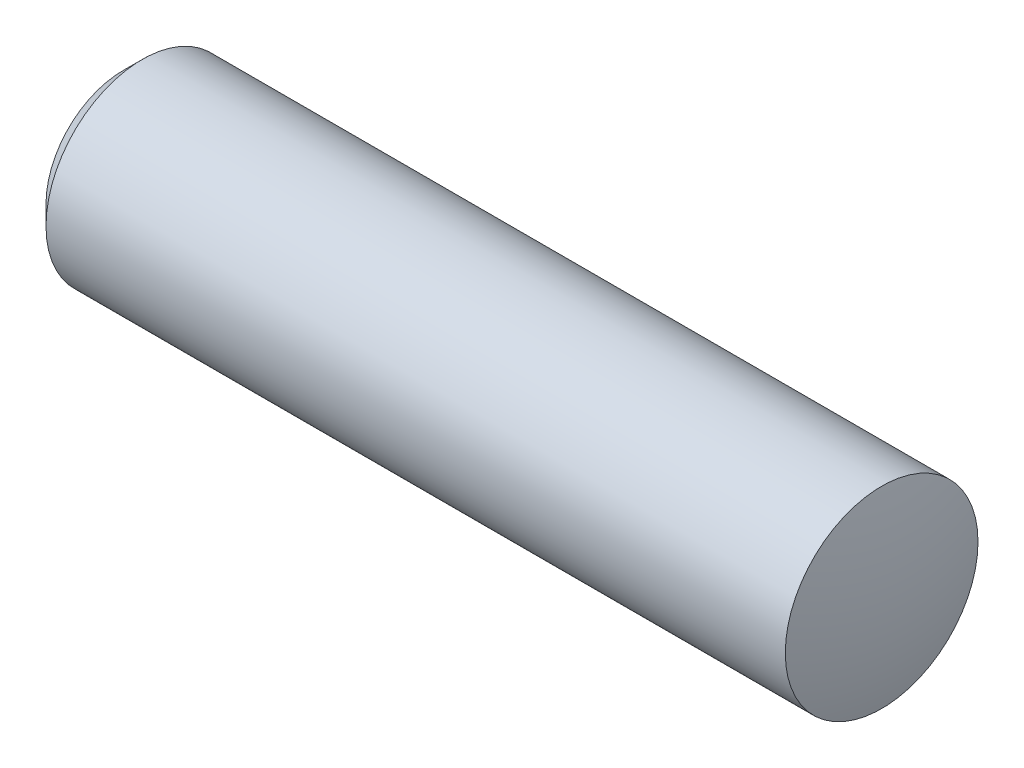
from build123d import *


with BuildPart() as part:
    # Sketch1 → Revolve1 (revolve)
    with BuildSketch(Plane(origin=(0, 0, 0), x_dir=(1, 0, 0), z_dir=(0, 1, 0)), mode=Mode.PRIVATE) as revolve1_sk:
        with BuildLine():
            Line((-12, 1.2), (-11.7, 1.5))
            Line((-11.7, 1.5), (-0.190524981, 1.5))
            ThreePointArc((-0.190524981, 1.5), (-0.047821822, 0.756025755), (0, 0))
            Line((0, 0), (-12, 0))
            Line((-12, 0), (-12, 1.2))
        make_face()
    revolve(revolve1_sk.sketch.rotate(Axis((0, 0, 0), (1, 0, 0)), 180), axis=Axis((0, 0, 0), (1, 0, 0)))


solid = part.part
